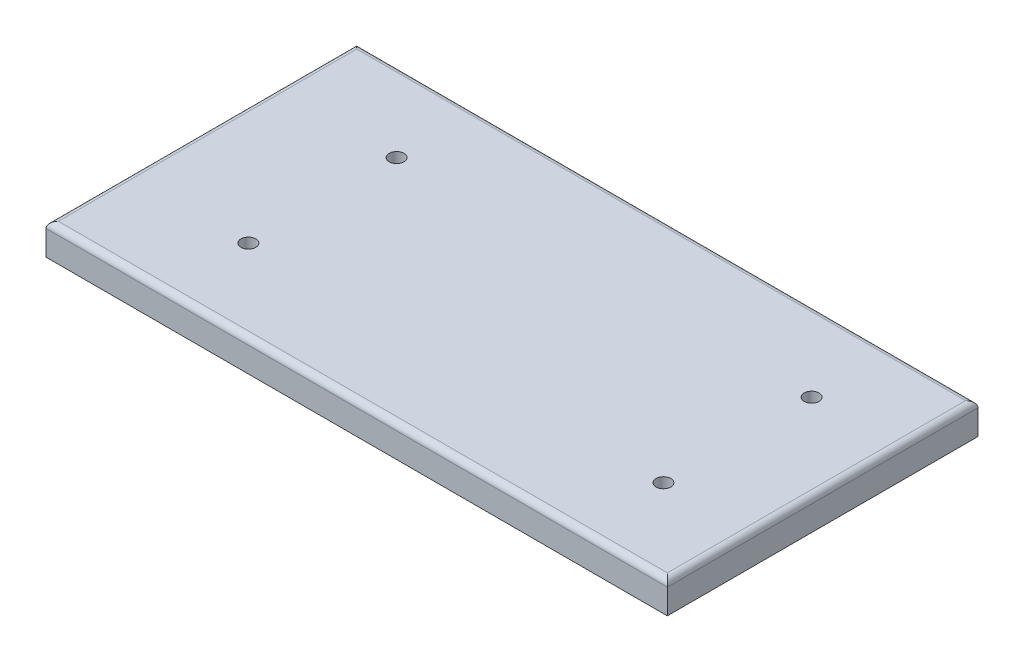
ISO-10303-21;
HEADER;
FILE_DESCRIPTION(('STEP AP214'),'2;1');
FILE_NAME('part.step','',(''),(''),'','','');
FILE_SCHEMA(('AUTOMOTIVE_DESIGN { 1 0 10303 214 1 1 1 1 }'));
ENDSEC;
DATA;
#1=APPLICATION_CONTEXT('core data for automotive mechanical design processes');
#2=APPLICATION_PROTOCOL_DEFINITION('international standard','automotive_design',2000,#1);
#3=PRODUCT_CONTEXT('',#1,'mechanical');
#4=PRODUCT('Part','Part','',(#3));
#5=PRODUCT_RELATED_PRODUCT_CATEGORY('part','',(#4));
#6=PRODUCT_DEFINITION_FORMATION('','',#4);
#7=PRODUCT_DEFINITION_CONTEXT('part definition',#1,'design');
#8=PRODUCT_DEFINITION('design','',#6,#7);
#9=PRODUCT_DEFINITION_SHAPE('','',#8);
#10=(LENGTH_UNIT() NAMED_UNIT(*) SI_UNIT(.MILLI.,.METRE.));
#11=(NAMED_UNIT(*) PLANE_ANGLE_UNIT() SI_UNIT($,.RADIAN.));
#12=(NAMED_UNIT(*) SI_UNIT($,.STERADIAN.) SOLID_ANGLE_UNIT());
#13=UNCERTAINTY_MEASURE_WITH_UNIT(LENGTH_MEASURE(1.E-05),#10,'distance_accuracy_value','');
#14=(GEOMETRIC_REPRESENTATION_CONTEXT(3) GLOBAL_UNCERTAINTY_ASSIGNED_CONTEXT((#13)) GLOBAL_UNIT_ASSIGNED_CONTEXT((#10,
#11,#12)) REPRESENTATION_CONTEXT('',''));
#15=CARTESIAN_POINT('',(0.,0.,0.));
#16=DIRECTION('',(0.,0.,1.));
#17=DIRECTION('',(1.,0.,0.));
#18=AXIS2_PLACEMENT_3D('',#15,#16,#17);
#19=CARTESIAN_POINT('',(0.,12.7,0.));
#20=DIRECTION('',(-1.,0.,0.));
#21=DIRECTION('',(0.,0.,1.));
#22=AXIS2_PLACEMENT_3D('',#19,#20,#21);
#23=PLANE('',#22);
#24=DIRECTION('',(0.,-1.,0.));
#25=VECTOR('',#24,1.);
#26=CARTESIAN_POINT('',(0.,12.7,-127.));
#27=LINE('',#26,#25);
#28=CARTESIAN_POINT('',(0.,10.16,-127.));
#29=VERTEX_POINT('',#28);
#30=CARTESIAN_POINT('',(0.,0.,-127.));
#31=VERTEX_POINT('',#30);
#32=EDGE_CURVE('E82',#29,#31,#27,.T.);
#33=ORIENTED_EDGE('',*,*,#32,.F.);
#34=DIRECTION('',(0.,0.,-1.));
#35=VECTOR('',#34,1.);
#36=CARTESIAN_POINT('',(0.,10.16,0.));
#37=LINE('',#36,#35);
#38=CARTESIAN_POINT('',(0.,10.16,0.));
#39=VERTEX_POINT('',#38);
#40=EDGE_CURVE('E131',#29,#39,#37,.F.);
#41=ORIENTED_EDGE('',*,*,#40,.T.);
#42=DIRECTION('',(0.,-1.,0.));
#43=VECTOR('',#42,1.);
#44=CARTESIAN_POINT('',(0.,12.7,0.));
#45=LINE('',#44,#43);
#46=CARTESIAN_POINT('',(0.,0.,0.));
#47=VERTEX_POINT('',#46);
#48=EDGE_CURVE('E102',#39,#47,#45,.T.);
#49=ORIENTED_EDGE('',*,*,#48,.T.);
#50=DIRECTION('',(0.,0.,-1.));
#51=VECTOR('',#50,1.);
#52=CARTESIAN_POINT('',(0.,0.,0.));
#53=LINE('',#52,#51);
#54=EDGE_CURVE('E97',#47,#31,#53,.T.);
#55=ORIENTED_EDGE('',*,*,#54,.T.);
#56=EDGE_LOOP('',(#33,#41,#49,#55));
#57=FACE_BOUND('',#56,.T.);
#58=ADVANCED_FACE('F31',(#57),#23,.F.);
#59=CARTESIAN_POINT('',(0.,12.7,-127.));
#60=DIRECTION('',(0.,0.,1.));
#61=DIRECTION('',(1.,0.,0.));
#62=AXIS2_PLACEMENT_3D('',#59,#60,#61);
#63=PLANE('',#62);
#64=DIRECTION('',(0.,-1.,0.));
#65=VECTOR('',#64,1.);
#66=CARTESIAN_POINT('',(-254.,12.7,-127.));
#67=LINE('',#66,#65);
#68=CARTESIAN_POINT('',(-254.,10.16,-127.));
#69=VERTEX_POINT('',#68);
#70=CARTESIAN_POINT('',(-254.,0.,-127.));
#71=VERTEX_POINT('',#70);
#72=EDGE_CURVE('E91',#69,#71,#67,.T.);
#73=ORIENTED_EDGE('',*,*,#72,.F.);
#74=DIRECTION('',(-1.,0.,0.));
#75=VECTOR('',#74,1.);
#76=CARTESIAN_POINT('',(0.,10.16,-127.));
#77=LINE('',#76,#75);
#78=EDGE_CURVE('E40',#69,#29,#77,.F.);
#79=ORIENTED_EDGE('',*,*,#78,.T.);
#80=ORIENTED_EDGE('',*,*,#32,.T.);
#81=DIRECTION('',(-1.,0.,0.));
#82=VECTOR('',#81,1.);
#83=CARTESIAN_POINT('',(0.,0.,-127.));
#84=LINE('',#83,#82);
#85=EDGE_CURVE('E85',#31,#71,#84,.T.);
#86=ORIENTED_EDGE('',*,*,#85,.T.);
#87=EDGE_LOOP('',(#73,#79,#80,#86));
#88=FACE_BOUND('',#87,.T.);
#89=ADVANCED_FACE('F84',(#88),#63,.F.);
#90=CARTESIAN_POINT('',(-254.,12.7,0.));
#91=DIRECTION('',(1.,0.,0.));
#92=DIRECTION('',(0.,0.,-1.));
#93=AXIS2_PLACEMENT_3D('',#90,#91,#92);
#94=PLANE('',#93);
#95=DIRECTION('',(0.,-1.,0.));
#96=VECTOR('',#95,1.);
#97=CARTESIAN_POINT('',(-254.,12.7,0.));
#98=LINE('',#97,#96);
#99=CARTESIAN_POINT('',(-254.,10.16,0.));
#100=VERTEX_POINT('',#99);
#101=CARTESIAN_POINT('',(-254.,0.,0.));
#102=VERTEX_POINT('',#101);
#103=EDGE_CURVE('E117',#100,#102,#98,.T.);
#104=ORIENTED_EDGE('',*,*,#103,.F.);
#105=DIRECTION('',(0.,0.,1.));
#106=VECTOR('',#105,1.);
#107=CARTESIAN_POINT('',(-254.,10.16,-127.));
#108=LINE('',#107,#106);
#109=EDGE_CURVE('E11',#100,#69,#108,.F.);
#110=ORIENTED_EDGE('',*,*,#109,.T.);
#111=ORIENTED_EDGE('',*,*,#72,.T.);
#112=DIRECTION('',(0.,0.,1.));
#113=VECTOR('',#112,1.);
#114=CARTESIAN_POINT('',(-254.,0.,0.));
#115=LINE('',#114,#113);
#116=EDGE_CURVE('E99',#71,#102,#115,.T.);
#117=ORIENTED_EDGE('',*,*,#116,.T.);
#118=EDGE_LOOP('',(#104,#110,#111,#117));
#119=FACE_BOUND('',#118,.T.);
#120=ADVANCED_FACE('F193',(#119),#94,.F.);
#121=CARTESIAN_POINT('',(0.,12.7,0.));
#122=DIRECTION('',(0.,0.,-1.));
#123=DIRECTION('',(-1.,0.,0.));
#124=AXIS2_PLACEMENT_3D('',#121,#122,#123);
#125=PLANE('',#124);
#126=ORIENTED_EDGE('',*,*,#48,.F.);
#127=DIRECTION('',(1.,0.,0.));
#128=VECTOR('',#127,1.);
#129=CARTESIAN_POINT('',(-254.,10.16,0.));
#130=LINE('',#129,#128);
#131=EDGE_CURVE('E128',#39,#100,#130,.F.);
#132=ORIENTED_EDGE('',*,*,#131,.T.);
#133=ORIENTED_EDGE('',*,*,#103,.T.);
#134=DIRECTION('',(1.,0.,0.));
#135=VECTOR('',#134,1.);
#136=CARTESIAN_POINT('',(0.,0.,0.));
#137=LINE('',#136,#135);
#138=EDGE_CURVE('E114',#102,#47,#137,.T.);
#139=ORIENTED_EDGE('',*,*,#138,.T.);
#140=EDGE_LOOP('',(#126,#132,#133,#139));
#141=FACE_BOUND('',#140,.T.);
#142=ADVANCED_FACE('F168',(#141),#125,.F.);
#143=CARTESIAN_POINT('',(0.,12.7,-127.));
#144=DIRECTION('',(0.,1.,0.));
#145=DIRECTION('',(0.,0.,1.));
#146=AXIS2_PLACEMENT_3D('',#143,#144,#145);
#147=PLANE('',#146);
#148=CARTESIAN_POINT('',(-35.2256163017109,12.7,-94.2146651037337));
#149=DIRECTION('',(0.,1.,0.));
#150=DIRECTION('',(0.,0.,1.));
#151=AXIS2_PLACEMENT_3D('',#148,#149,#150);
#152=CIRCLE('',#151,3.0226);
#153=CARTESIAN_POINT('',(-35.2256163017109,12.7,-91.1920651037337));
#154=VERTEX_POINT('',#153);
#155=EDGE_CURVE('E157',#154,#154,#152,.T.);
#156=ORIENTED_EDGE('',*,*,#155,.F.);
#157=EDGE_LOOP('',(#156));
#158=FACE_BOUND('',#157,.T.);
#159=CARTESIAN_POINT('',(-35.2256163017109,12.7,-33.6356651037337));
#160=DIRECTION('',(0.,1.,0.));
#161=DIRECTION('',(0.,0.,1.));
#162=AXIS2_PLACEMENT_3D('',#159,#160,#161);
#163=CIRCLE('',#162,3.0226);
#164=CARTESIAN_POINT('',(-35.2256163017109,12.7,-30.6130651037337));
#165=VERTEX_POINT('',#164);
#166=EDGE_CURVE('E148',#165,#165,#163,.T.);
#167=ORIENTED_EDGE('',*,*,#166,.F.);
#168=EDGE_LOOP('',(#167));
#169=FACE_BOUND('',#168,.T.);
#170=CARTESIAN_POINT('',(-204.897616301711,12.7,-33.6356651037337));
#171=DIRECTION('',(0.,1.,0.));
#172=DIRECTION('',(0.,0.,1.));
#173=AXIS2_PLACEMENT_3D('',#170,#171,#172);
#174=CIRCLE('',#173,3.02259999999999);
#175=CARTESIAN_POINT('',(-204.897616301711,12.7,-30.6130651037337));
#176=VERTEX_POINT('',#175);
#177=EDGE_CURVE('E145',#176,#176,#174,.T.);
#178=ORIENTED_EDGE('',*,*,#177,.F.);
#179=EDGE_LOOP('',(#178));
#180=FACE_BOUND('',#179,.T.);
#181=CARTESIAN_POINT('',(-204.897616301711,12.7,-94.2146651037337));
#182=DIRECTION('',(0.,1.,0.));
#183=DIRECTION('',(0.,0.,1.));
#184=AXIS2_PLACEMENT_3D('',#181,#182,#183);
#185=CIRCLE('',#184,3.02259999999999);
#186=CARTESIAN_POINT('',(-204.897616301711,12.7,-91.1920651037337));
#187=VERTEX_POINT('',#186);
#188=EDGE_CURVE('E110',#187,#187,#185,.T.);
#189=ORIENTED_EDGE('',*,*,#188,.F.);
#190=EDGE_LOOP('',(#189));
#191=FACE_BOUND('',#190,.T.);
#192=DIRECTION('',(0.,0.,1.));
#193=VECTOR('',#192,1.);
#194=CARTESIAN_POINT('',(-251.46,12.7,0.));
#195=LINE('',#194,#193);
#196=CARTESIAN_POINT('',(-251.46,12.7,-124.46));
#197=VERTEX_POINT('',#196);
#198=CARTESIAN_POINT('',(-251.46,12.7,-2.53999999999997));
#199=VERTEX_POINT('',#198);
#200=EDGE_CURVE('E90',#197,#199,#195,.T.);
#201=ORIENTED_EDGE('',*,*,#200,.T.);
#202=DIRECTION('',(1.,0.,0.));
#203=VECTOR('',#202,1.);
#204=CARTESIAN_POINT('',(0.,12.7,-2.54));
#205=LINE('',#204,#203);
#206=CARTESIAN_POINT('',(-2.54,12.7,-2.54));
#207=VERTEX_POINT('',#206);
#208=EDGE_CURVE('E125',#199,#207,#205,.T.);
#209=ORIENTED_EDGE('',*,*,#208,.T.);
#210=DIRECTION('',(0.,0.,-1.));
#211=VECTOR('',#210,1.);
#212=CARTESIAN_POINT('',(-2.54,12.7,-127.));
#213=LINE('',#212,#211);
#214=CARTESIAN_POINT('',(-2.54,12.7,-124.46));
#215=VERTEX_POINT('',#214);
#216=EDGE_CURVE('E123',#207,#215,#213,.T.);
#217=ORIENTED_EDGE('',*,*,#216,.T.);
#218=DIRECTION('',(-1.,0.,0.));
#219=VECTOR('',#218,1.);
#220=CARTESIAN_POINT('',(-254.,12.7,-124.46));
#221=LINE('',#220,#219);
#222=EDGE_CURVE('E121',#215,#197,#221,.T.);
#223=ORIENTED_EDGE('',*,*,#222,.T.);
#224=EDGE_LOOP('',(#201,#209,#217,#223));
#225=FACE_BOUND('',#224,.T.);
#226=ADVANCED_FACE('F165',(#158,#169,#180,#191,#225),#147,.T.);
#227=CARTESIAN_POINT('',(0.,0.,-127.));
#228=DIRECTION('',(0.,1.,0.));
#229=DIRECTION('',(0.,0.,1.));
#230=AXIS2_PLACEMENT_3D('',#227,#228,#229);
#231=PLANE('',#230);
#232=CARTESIAN_POINT('',(-35.2256163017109,0.,-94.2146651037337));
#233=DIRECTION('',(0.,1.,0.));
#234=DIRECTION('',(0.,0.,1.));
#235=AXIS2_PLACEMENT_3D('',#232,#233,#234);
#236=CIRCLE('',#235,3.0226);
#237=CARTESIAN_POINT('',(-35.2256163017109,0.,-91.1920651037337));
#238=VERTEX_POINT('',#237);
#239=EDGE_CURVE('E35',#238,#238,#236,.T.);
#240=ORIENTED_EDGE('',*,*,#239,.T.);
#241=EDGE_LOOP('',(#240));
#242=FACE_BOUND('',#241,.T.);
#243=CARTESIAN_POINT('',(-35.2256163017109,0.,-33.6356651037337));
#244=DIRECTION('',(0.,1.,0.));
#245=DIRECTION('',(0.,0.,1.));
#246=AXIS2_PLACEMENT_3D('',#243,#244,#245);
#247=CIRCLE('',#246,3.0226);
#248=CARTESIAN_POINT('',(-35.2256163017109,0.,-30.6130651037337));
#249=VERTEX_POINT('',#248);
#250=EDGE_CURVE('E146',#249,#249,#247,.T.);
#251=ORIENTED_EDGE('',*,*,#250,.T.);
#252=EDGE_LOOP('',(#251));
#253=FACE_BOUND('',#252,.T.);
#254=CARTESIAN_POINT('',(-204.897616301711,0.,-33.6356651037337));
#255=DIRECTION('',(0.,1.,0.));
#256=DIRECTION('',(0.,0.,1.));
#257=AXIS2_PLACEMENT_3D('',#254,#255,#256);
#258=CIRCLE('',#257,3.02259999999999);
#259=CARTESIAN_POINT('',(-204.897616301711,0.,-30.6130651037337));
#260=VERTEX_POINT('',#259);
#261=EDGE_CURVE('E143',#260,#260,#258,.T.);
#262=ORIENTED_EDGE('',*,*,#261,.T.);
#263=EDGE_LOOP('',(#262));
#264=FACE_BOUND('',#263,.T.);
#265=CARTESIAN_POINT('',(-204.897616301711,0.,-94.2146651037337));
#266=DIRECTION('',(0.,1.,0.));
#267=DIRECTION('',(0.,0.,1.));
#268=AXIS2_PLACEMENT_3D('',#265,#266,#267);
#269=CIRCLE('',#268,3.02259999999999);
#270=CARTESIAN_POINT('',(-204.897616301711,0.,-91.1920651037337));
#271=VERTEX_POINT('',#270);
#272=EDGE_CURVE('E137',#271,#271,#269,.T.);
#273=ORIENTED_EDGE('',*,*,#272,.T.);
#274=EDGE_LOOP('',(#273));
#275=FACE_BOUND('',#274,.T.);
#276=ORIENTED_EDGE('',*,*,#54,.F.);
#277=ORIENTED_EDGE('',*,*,#138,.F.);
#278=ORIENTED_EDGE('',*,*,#116,.F.);
#279=ORIENTED_EDGE('',*,*,#85,.F.);
#280=EDGE_LOOP('',(#276,#277,#278,#279));
#281=FACE_BOUND('',#280,.T.);
#282=ADVANCED_FACE('F95',(#242,#253,#264,#275,#281),#231,.F.);
#283=CARTESIAN_POINT('',(0.,10.16,-124.46));
#284=DIRECTION('',(1.,0.,0.));
#285=DIRECTION('',(0.,0.,-1.));
#286=AXIS2_PLACEMENT_3D('',#283,#284,#285);
#287=CYLINDRICAL_SURFACE('',#286,2.54);
#288=CARTESIAN_POINT('',(-2.54,10.16,-124.46));
#289=DIRECTION('',(0.707106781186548,0.,0.707106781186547));
#290=DIRECTION('',(0.707106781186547,0.,-0.707106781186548));
#291=AXIS2_PLACEMENT_3D('',#288,#289,#290);
#292=ELLIPSE('',#291,3.59210244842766,2.54);
#293=EDGE_CURVE('E107',#29,#215,#292,.T.);
#294=ORIENTED_EDGE('',*,*,#293,.F.);
#295=ORIENTED_EDGE('',*,*,#78,.F.);
#296=CARTESIAN_POINT('',(-251.46,10.16,-124.46));
#297=DIRECTION('',(0.707106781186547,0.,-0.707106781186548));
#298=DIRECTION('',(-0.707106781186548,0.,-0.707106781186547));
#299=AXIS2_PLACEMENT_3D('',#296,#297,#298);
#300=ELLIPSE('',#299,3.59210244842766,2.54);
#301=EDGE_CURVE('E104',#197,#69,#300,.F.);
#302=ORIENTED_EDGE('',*,*,#301,.F.);
#303=ORIENTED_EDGE('',*,*,#222,.F.);
#304=EDGE_LOOP('',(#294,#295,#302,#303));
#305=FACE_BOUND('',#304,.T.);
#306=ADVANCED_FACE('F33',(#305),#287,.T.);
#307=CARTESIAN_POINT('',(-251.46,10.16,-127.));
#308=DIRECTION('',(0.,0.,-1.));
#309=DIRECTION('',(-1.,0.,0.));
#310=AXIS2_PLACEMENT_3D('',#307,#308,#309);
#311=CYLINDRICAL_SURFACE('',#310,2.54);
#312=ORIENTED_EDGE('',*,*,#301,.T.);
#313=ORIENTED_EDGE('',*,*,#109,.F.);
#314=CARTESIAN_POINT('',(-251.46,10.16,-2.53999999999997));
#315=DIRECTION('',(-0.707106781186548,0.,-0.707106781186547));
#316=DIRECTION('',(0.707106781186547,0.,-0.707106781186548));
#317=AXIS2_PLACEMENT_3D('',#314,#315,#316);
#318=ELLIPSE('',#317,3.59210244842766,2.54);
#319=EDGE_CURVE('E136',#199,#100,#318,.F.);
#320=ORIENTED_EDGE('',*,*,#319,.F.);
#321=ORIENTED_EDGE('',*,*,#200,.F.);
#322=EDGE_LOOP('',(#312,#313,#320,#321));
#323=FACE_BOUND('',#322,.T.);
#324=ADVANCED_FACE('F182',(#323),#311,.T.);
#325=CARTESIAN_POINT('',(-2.54,10.16,-127.));
#326=DIRECTION('',(0.,0.,1.));
#327=DIRECTION('',(1.,0.,0.));
#328=AXIS2_PLACEMENT_3D('',#325,#326,#327);
#329=CYLINDRICAL_SURFACE('',#328,2.54);
#330=ORIENTED_EDGE('',*,*,#293,.T.);
#331=ORIENTED_EDGE('',*,*,#216,.F.);
#332=CARTESIAN_POINT('',(-2.54,10.16,-2.54));
#333=DIRECTION('',(-0.707106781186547,0.,0.707106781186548));
#334=DIRECTION('',(0.707106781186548,0.,0.707106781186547));
#335=AXIS2_PLACEMENT_3D('',#332,#333,#334);
#336=ELLIPSE('',#335,3.59210244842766,2.54);
#337=EDGE_CURVE('E134',#39,#207,#336,.T.);
#338=ORIENTED_EDGE('',*,*,#337,.F.);
#339=ORIENTED_EDGE('',*,*,#40,.F.);
#340=EDGE_LOOP('',(#330,#331,#338,#339));
#341=FACE_BOUND('',#340,.T.);
#342=ADVANCED_FACE('F190',(#341),#329,.T.);
#343=CARTESIAN_POINT('',(0.,10.16,-2.54));
#344=DIRECTION('',(-1.,0.,0.));
#345=DIRECTION('',(0.,0.,1.));
#346=AXIS2_PLACEMENT_3D('',#343,#344,#345);
#347=CYLINDRICAL_SURFACE('',#346,2.54);
#348=ORIENTED_EDGE('',*,*,#319,.T.);
#349=ORIENTED_EDGE('',*,*,#131,.F.);
#350=ORIENTED_EDGE('',*,*,#337,.T.);
#351=ORIENTED_EDGE('',*,*,#208,.F.);
#352=EDGE_LOOP('',(#348,#349,#350,#351));
#353=FACE_BOUND('',#352,.T.);
#354=ADVANCED_FACE('F185',(#353),#347,.T.);
#355=CARTESIAN_POINT('',(-204.897616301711,12.7,-94.2146651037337));
#356=DIRECTION('',(0.,1.,0.));
#357=DIRECTION('',(0.,0.,1.));
#358=AXIS2_PLACEMENT_3D('',#355,#356,#357);
#359=CYLINDRICAL_SURFACE('',#358,3.02259999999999);
#360=ORIENTED_EDGE('',*,*,#188,.T.);
#361=EDGE_LOOP('',(#360));
#362=FACE_BOUND('',#361,.T.);
#363=ORIENTED_EDGE('',*,*,#272,.F.);
#364=EDGE_LOOP('',(#363));
#365=FACE_BOUND('',#364,.T.);
#366=ADVANCED_FACE('F209',(#362,#365),#359,.F.);
#367=CARTESIAN_POINT('',(-204.897616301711,12.7,-33.6356651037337));
#368=DIRECTION('',(0.,1.,0.));
#369=DIRECTION('',(0.,0.,1.));
#370=AXIS2_PLACEMENT_3D('',#367,#368,#369);
#371=CYLINDRICAL_SURFACE('',#370,3.02259999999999);
#372=ORIENTED_EDGE('',*,*,#177,.T.);
#373=EDGE_LOOP('',(#372));
#374=FACE_BOUND('',#373,.T.);
#375=ORIENTED_EDGE('',*,*,#261,.F.);
#376=EDGE_LOOP('',(#375));
#377=FACE_BOUND('',#376,.T.);
#378=ADVANCED_FACE('F225',(#374,#377),#371,.F.);
#379=CARTESIAN_POINT('',(-35.2256163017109,12.7,-33.6356651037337));
#380=DIRECTION('',(0.,1.,0.));
#381=DIRECTION('',(0.,0.,1.));
#382=AXIS2_PLACEMENT_3D('',#379,#380,#381);
#383=CYLINDRICAL_SURFACE('',#382,3.0226);
#384=ORIENTED_EDGE('',*,*,#166,.T.);
#385=EDGE_LOOP('',(#384));
#386=FACE_BOUND('',#385,.T.);
#387=ORIENTED_EDGE('',*,*,#250,.F.);
#388=EDGE_LOOP('',(#387));
#389=FACE_BOUND('',#388,.T.);
#390=ADVANCED_FACE('F229',(#386,#389),#383,.F.);
#391=CARTESIAN_POINT('',(-35.2256163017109,12.7,-94.2146651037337));
#392=DIRECTION('',(0.,1.,0.));
#393=DIRECTION('',(0.,0.,1.));
#394=AXIS2_PLACEMENT_3D('',#391,#392,#393);
#395=CYLINDRICAL_SURFACE('',#394,3.0226);
#396=ORIENTED_EDGE('',*,*,#155,.T.);
#397=EDGE_LOOP('',(#396));
#398=FACE_BOUND('',#397,.T.);
#399=ORIENTED_EDGE('',*,*,#239,.F.);
#400=EDGE_LOOP('',(#399));
#401=FACE_BOUND('',#400,.T.);
#402=ADVANCED_FACE('F162',(#398,#401),#395,.F.);
#403=CLOSED_SHELL('',(#58,#89,#120,#142,#226,#282,#306,#324,#342,#354,#366,#378,#390,#402));
#404=MANIFOLD_SOLID_BREP('B2',#403);
#405=ADVANCED_BREP_SHAPE_REPRESENTATION('',(#18,#404),#14);
#406=SHAPE_DEFINITION_REPRESENTATION(#9,#405);
ENDSEC;
END-ISO-10303-21;
